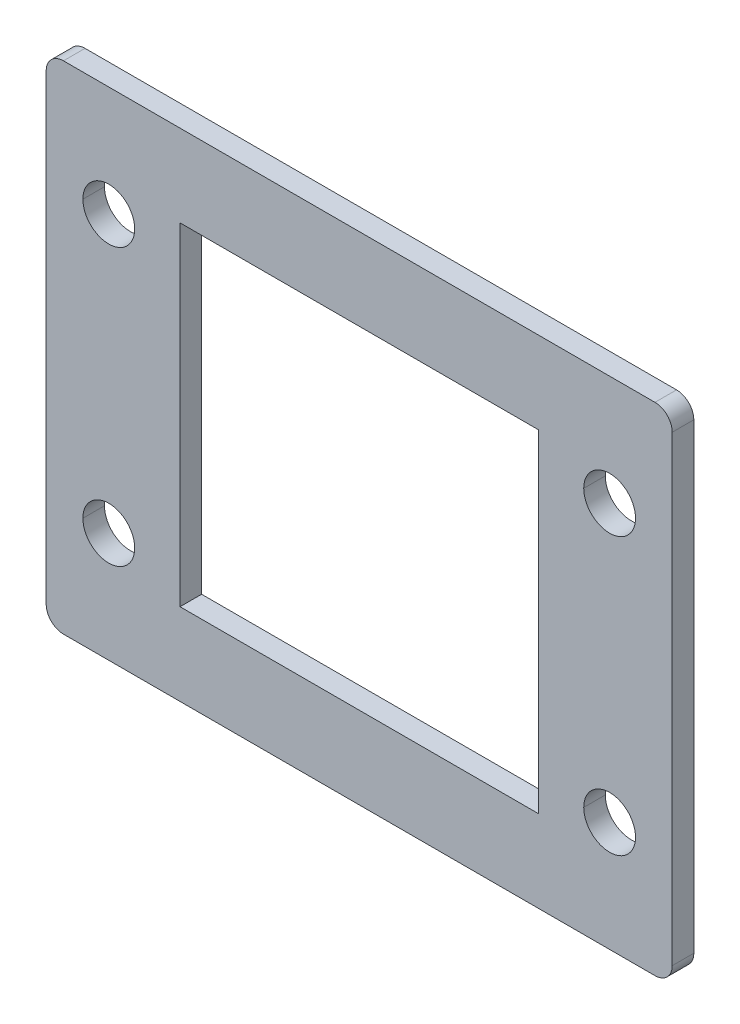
ISO-10303-21;
HEADER;
FILE_DESCRIPTION(('STEP AP214'),'2;1');
FILE_NAME('part.step','',(''),(''),'','','');
FILE_SCHEMA(('AUTOMOTIVE_DESIGN { 1 0 10303 214 1 1 1 1 }'));
ENDSEC;
DATA;
#1=APPLICATION_CONTEXT('core data for automotive mechanical design processes');
#2=APPLICATION_PROTOCOL_DEFINITION('international standard','automotive_design',2000,#1);
#3=PRODUCT_CONTEXT('',#1,'mechanical');
#4=PRODUCT('Part','Part','',(#3));
#5=PRODUCT_RELATED_PRODUCT_CATEGORY('part','',(#4));
#6=PRODUCT_DEFINITION_FORMATION('','',#4);
#7=PRODUCT_DEFINITION_CONTEXT('part definition',#1,'design');
#8=PRODUCT_DEFINITION('design','',#6,#7);
#9=PRODUCT_DEFINITION_SHAPE('','',#8);
#10=(LENGTH_UNIT() NAMED_UNIT(*) SI_UNIT(.MILLI.,.METRE.));
#11=(NAMED_UNIT(*) PLANE_ANGLE_UNIT() SI_UNIT($,.RADIAN.));
#12=(NAMED_UNIT(*) SI_UNIT($,.STERADIAN.) SOLID_ANGLE_UNIT());
#13=UNCERTAINTY_MEASURE_WITH_UNIT(LENGTH_MEASURE(1.E-05),#10,'distance_accuracy_value','');
#14=(GEOMETRIC_REPRESENTATION_CONTEXT(3) GLOBAL_UNCERTAINTY_ASSIGNED_CONTEXT((#13)) GLOBAL_UNIT_ASSIGNED_CONTEXT((#10,
#11,#12)) REPRESENTATION_CONTEXT('',''));
#15=CARTESIAN_POINT('',(0.,0.,0.));
#16=DIRECTION('',(0.,0.,1.));
#17=DIRECTION('',(1.,0.,0.));
#18=AXIS2_PLACEMENT_3D('',#15,#16,#17);
#19=CARTESIAN_POINT('',(3.82808590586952,41.3391777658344,23.4913418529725));
#20=DIRECTION('',(0.,0.,-1.));
#21=DIRECTION('',(-1.,0.,0.));
#22=AXIS2_PLACEMENT_3D('',#19,#20,#21);
#23=CYLINDRICAL_SURFACE('',#22,3.);
#24=DIRECTION('',(0.,0.,-1.));
#25=VECTOR('',#24,1.);
#26=CARTESIAN_POINT('',(6.82808590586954,41.3391777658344,23.4913418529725));
#27=LINE('',#26,#25);
#28=CARTESIAN_POINT('',(6.82808590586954,41.3391777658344,15.0060604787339));
#29=VERTEX_POINT('',#28);
#30=CARTESIAN_POINT('',(6.82808590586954,41.3391777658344,12.5060604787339));
#31=VERTEX_POINT('',#30);
#32=EDGE_CURVE('E210',#29,#31,#27,.T.);
#33=ORIENTED_EDGE('',*,*,#32,.F.);
#34=CARTESIAN_POINT('',(3.82808590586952,41.3391777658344,15.0060604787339));
#35=DIRECTION('',(0.,0.,-1.));
#36=DIRECTION('',(-1.,0.,0.));
#37=AXIS2_PLACEMENT_3D('',#34,#35,#36);
#38=CIRCLE('',#37,3.);
#39=CARTESIAN_POINT('',(0.828085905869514,41.3391777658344,15.0060604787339));
#40=VERTEX_POINT('',#39);
#41=EDGE_CURVE('E196',#40,#29,#38,.T.);
#42=ORIENTED_EDGE('',*,*,#41,.F.);
#43=DIRECTION('',(0.,0.,-1.));
#44=VECTOR('',#43,1.);
#45=CARTESIAN_POINT('',(0.828085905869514,41.3391777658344,23.4913418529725));
#46=LINE('',#45,#44);
#47=CARTESIAN_POINT('',(0.828085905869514,41.3391777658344,12.5060604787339));
#48=VERTEX_POINT('',#47);
#49=EDGE_CURVE('E219',#40,#48,#46,.T.);
#50=ORIENTED_EDGE('',*,*,#49,.T.);
#51=CARTESIAN_POINT('',(3.82808590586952,41.3391777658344,12.5060604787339));
#52=DIRECTION('',(0.,0.,1.));
#53=DIRECTION('',(1.,0.,0.));
#54=AXIS2_PLACEMENT_3D('',#51,#52,#53);
#55=CIRCLE('',#54,3.);
#56=EDGE_CURVE('E211',#31,#48,#55,.T.);
#57=ORIENTED_EDGE('',*,*,#56,.F.);
#58=EDGE_LOOP('',(#33,#42,#50,#57));
#59=FACE_BOUND('',#58,.T.);
#60=ADVANCED_FACE('F15',(#59),#23,.F.);
#61=CARTESIAN_POINT('',(-54.1719140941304,41.3391777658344,23.4913418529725));
#62=DIRECTION('',(0.,0.,-1.));
#63=DIRECTION('',(-1.,0.,0.));
#64=AXIS2_PLACEMENT_3D('',#61,#62,#63);
#65=CYLINDRICAL_SURFACE('',#64,3.);
#66=DIRECTION('',(0.,0.,-1.));
#67=VECTOR('',#66,1.);
#68=CARTESIAN_POINT('',(-51.1719140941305,41.3391777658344,23.4913418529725));
#69=LINE('',#68,#67);
#70=CARTESIAN_POINT('',(-51.1719140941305,41.3391777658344,15.0060604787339));
#71=VERTEX_POINT('',#70);
#72=CARTESIAN_POINT('',(-51.1719140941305,41.3391777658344,12.5060604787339));
#73=VERTEX_POINT('',#72);
#74=EDGE_CURVE('E242',#71,#73,#69,.T.);
#75=ORIENTED_EDGE('',*,*,#74,.F.);
#76=CARTESIAN_POINT('',(-54.1719140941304,41.3391777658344,15.0060604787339));
#77=DIRECTION('',(0.,0.,-1.));
#78=DIRECTION('',(-1.,0.,0.));
#79=AXIS2_PLACEMENT_3D('',#76,#77,#78);
#80=CIRCLE('',#79,3.);
#81=CARTESIAN_POINT('',(-57.1719140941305,41.3391777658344,15.0060604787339));
#82=VERTEX_POINT('',#81);
#83=EDGE_CURVE('E207',#82,#71,#80,.T.);
#84=ORIENTED_EDGE('',*,*,#83,.F.);
#85=DIRECTION('',(0.,0.,-1.));
#86=VECTOR('',#85,1.);
#87=CARTESIAN_POINT('',(-57.1719140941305,41.3391777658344,23.4913418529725));
#88=LINE('',#87,#86);
#89=CARTESIAN_POINT('',(-57.1719140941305,41.3391777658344,12.5060604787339));
#90=VERTEX_POINT('',#89);
#91=EDGE_CURVE('E261',#82,#90,#88,.T.);
#92=ORIENTED_EDGE('',*,*,#91,.T.);
#93=CARTESIAN_POINT('',(-54.1719140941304,41.3391777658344,12.5060604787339));
#94=DIRECTION('',(0.,0.,1.));
#95=DIRECTION('',(1.,0.,0.));
#96=AXIS2_PLACEMENT_3D('',#93,#94,#95);
#97=CIRCLE('',#96,3.);
#98=EDGE_CURVE('E379',#73,#90,#97,.T.);
#99=ORIENTED_EDGE('',*,*,#98,.F.);
#100=EDGE_LOOP('',(#75,#84,#92,#99));
#101=FACE_BOUND('',#100,.T.);
#102=ADVANCED_FACE('F446',(#101),#65,.F.);
#103=CARTESIAN_POINT('',(9.07808590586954,52.0891777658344,15.0060604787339));
#104=DIRECTION('',(0.,0.,-1.));
#105=DIRECTION('',(-1.,0.,0.));
#106=AXIS2_PLACEMENT_3D('',#103,#104,#105);
#107=CYLINDRICAL_SURFACE('',#106,2.);
#108=CARTESIAN_POINT('',(9.07808590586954,52.0891777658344,15.0060604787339));
#109=DIRECTION('',(0.,0.,1.));
#110=DIRECTION('',(-1.,0.,0.));
#111=AXIS2_PLACEMENT_3D('',#108,#109,#110);
#112=CIRCLE('',#111,2.);
#113=CARTESIAN_POINT('',(11.0780859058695,52.0891777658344,15.0060604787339));
#114=VERTEX_POINT('',#113);
#115=CARTESIAN_POINT('',(9.07808590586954,54.0891777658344,15.0060604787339));
#116=VERTEX_POINT('',#115);
#117=EDGE_CURVE('E321',#114,#116,#112,.T.);
#118=ORIENTED_EDGE('',*,*,#117,.F.);
#119=DIRECTION('',(0.,0.,1.));
#120=VECTOR('',#119,1.);
#121=CARTESIAN_POINT('',(11.0780859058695,52.0891777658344,15.0060604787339));
#122=LINE('',#121,#120);
#123=CARTESIAN_POINT('',(11.0780859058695,52.0891777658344,12.5060604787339));
#124=VERTEX_POINT('',#123);
#125=EDGE_CURVE('E246',#124,#114,#122,.T.);
#126=ORIENTED_EDGE('',*,*,#125,.F.);
#127=CARTESIAN_POINT('',(9.07808590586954,52.0891777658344,12.5060604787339));
#128=DIRECTION('',(0.,0.,-1.));
#129=DIRECTION('',(-1.,0.,0.));
#130=AXIS2_PLACEMENT_3D('',#127,#128,#129);
#131=CIRCLE('',#130,2.);
#132=CARTESIAN_POINT('',(9.07808590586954,54.0891777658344,12.5060604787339));
#133=VERTEX_POINT('',#132);
#134=EDGE_CURVE('E360',#133,#124,#131,.T.);
#135=ORIENTED_EDGE('',*,*,#134,.F.);
#136=DIRECTION('',(0.,0.,-1.));
#137=VECTOR('',#136,1.);
#138=CARTESIAN_POINT('',(9.07808590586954,54.0891777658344,15.0060604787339));
#139=LINE('',#138,#137);
#140=EDGE_CURVE('E411',#116,#133,#139,.T.);
#141=ORIENTED_EDGE('',*,*,#140,.F.);
#142=EDGE_LOOP('',(#118,#126,#135,#141));
#143=FACE_BOUND('',#142,.T.);
#144=ADVANCED_FACE('F450',(#143),#107,.T.);
#145=CARTESIAN_POINT('',(9.07808590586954,-1.41082223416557,15.0060604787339));
#146=DIRECTION('',(0.,0.,-1.));
#147=DIRECTION('',(-1.,0.,0.));
#148=AXIS2_PLACEMENT_3D('',#145,#146,#147);
#149=CYLINDRICAL_SURFACE('',#148,2.);
#150=CARTESIAN_POINT('',(9.07808590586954,-1.41082223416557,15.0060604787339));
#151=DIRECTION('',(0.,0.,1.));
#152=DIRECTION('',(-1.,0.,0.));
#153=AXIS2_PLACEMENT_3D('',#150,#151,#152);
#154=CIRCLE('',#153,2.);
#155=CARTESIAN_POINT('',(9.07808590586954,-3.41082223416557,15.0060604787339));
#156=VERTEX_POINT('',#155);
#157=CARTESIAN_POINT('',(11.0780859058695,-1.41082223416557,15.0060604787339));
#158=VERTEX_POINT('',#157);
#159=EDGE_CURVE('E313',#156,#158,#154,.T.);
#160=ORIENTED_EDGE('',*,*,#159,.F.);
#161=DIRECTION('',(0.,0.,1.));
#162=VECTOR('',#161,1.);
#163=CARTESIAN_POINT('',(9.07808590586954,-3.41082223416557,15.0060604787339));
#164=LINE('',#163,#162);
#165=CARTESIAN_POINT('',(9.07808590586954,-3.41082223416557,12.5060604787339));
#166=VERTEX_POINT('',#165);
#167=EDGE_CURVE('E247',#166,#156,#164,.T.);
#168=ORIENTED_EDGE('',*,*,#167,.F.);
#169=CARTESIAN_POINT('',(9.07808590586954,-1.41082223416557,12.5060604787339));
#170=DIRECTION('',(0.,0.,-1.));
#171=DIRECTION('',(-1.,0.,0.));
#172=AXIS2_PLACEMENT_3D('',#169,#170,#171);
#173=CIRCLE('',#172,2.);
#174=CARTESIAN_POINT('',(11.0780859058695,-1.41082223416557,12.5060604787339));
#175=VERTEX_POINT('',#174);
#176=EDGE_CURVE('E274',#175,#166,#173,.T.);
#177=ORIENTED_EDGE('',*,*,#176,.F.);
#178=DIRECTION('',(0.,0.,-1.));
#179=VECTOR('',#178,1.);
#180=CARTESIAN_POINT('',(11.0780859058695,-1.41082223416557,15.0060604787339));
#181=LINE('',#180,#179);
#182=EDGE_CURVE('E243',#158,#175,#181,.T.);
#183=ORIENTED_EDGE('',*,*,#182,.F.);
#184=EDGE_LOOP('',(#160,#168,#177,#183));
#185=FACE_BOUND('',#184,.T.);
#186=ADVANCED_FACE('F455',(#185),#149,.T.);
#187=CARTESIAN_POINT('',(-59.4219140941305,-1.41082223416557,15.0060604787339));
#188=DIRECTION('',(0.,0.,-1.));
#189=DIRECTION('',(-1.,0.,0.));
#190=AXIS2_PLACEMENT_3D('',#187,#188,#189);
#191=CYLINDRICAL_SURFACE('',#190,2.);
#192=CARTESIAN_POINT('',(-59.4219140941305,-1.41082223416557,15.0060604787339));
#193=DIRECTION('',(0.,0.,1.));
#194=DIRECTION('',(-1.,0.,0.));
#195=AXIS2_PLACEMENT_3D('',#192,#193,#194);
#196=CIRCLE('',#195,2.);
#197=CARTESIAN_POINT('',(-61.4219140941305,-1.41082223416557,15.0060604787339));
#198=VERTEX_POINT('',#197);
#199=CARTESIAN_POINT('',(-59.4219140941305,-3.41082223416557,15.0060604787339));
#200=VERTEX_POINT('',#199);
#201=EDGE_CURVE('E305',#198,#200,#196,.T.);
#202=ORIENTED_EDGE('',*,*,#201,.F.);
#203=DIRECTION('',(0.,0.,1.));
#204=VECTOR('',#203,1.);
#205=CARTESIAN_POINT('',(-61.4219140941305,-1.41082223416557,15.0060604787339));
#206=LINE('',#205,#204);
#207=CARTESIAN_POINT('',(-61.4219140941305,-1.41082223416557,12.5060604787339));
#208=VERTEX_POINT('',#207);
#209=EDGE_CURVE('E368',#208,#198,#206,.T.);
#210=ORIENTED_EDGE('',*,*,#209,.F.);
#211=CARTESIAN_POINT('',(-59.4219140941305,-1.41082223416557,12.5060604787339));
#212=DIRECTION('',(0.,0.,-1.));
#213=DIRECTION('',(-1.,0.,0.));
#214=AXIS2_PLACEMENT_3D('',#211,#212,#213);
#215=CIRCLE('',#214,2.);
#216=CARTESIAN_POINT('',(-59.4219140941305,-3.41082223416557,12.5060604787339));
#217=VERTEX_POINT('',#216);
#218=EDGE_CURVE('E273',#217,#208,#215,.T.);
#219=ORIENTED_EDGE('',*,*,#218,.F.);
#220=DIRECTION('',(0.,0.,-1.));
#221=VECTOR('',#220,1.);
#222=CARTESIAN_POINT('',(-59.4219140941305,-3.41082223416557,15.0060604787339));
#223=LINE('',#222,#221);
#224=EDGE_CURVE('E371',#200,#217,#223,.T.);
#225=ORIENTED_EDGE('',*,*,#224,.F.);
#226=EDGE_LOOP('',(#202,#210,#219,#225));
#227=FACE_BOUND('',#226,.T.);
#228=ADVANCED_FACE('F462',(#227),#191,.T.);
#229=CARTESIAN_POINT('',(-59.4219140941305,52.0891777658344,15.0060604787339));
#230=DIRECTION('',(0.,0.,-1.));
#231=DIRECTION('',(-1.,0.,0.));
#232=AXIS2_PLACEMENT_3D('',#229,#230,#231);
#233=CYLINDRICAL_SURFACE('',#232,2.);
#234=CARTESIAN_POINT('',(-59.4219140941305,52.0891777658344,15.0060604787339));
#235=DIRECTION('',(0.,0.,1.));
#236=DIRECTION('',(-1.,0.,0.));
#237=AXIS2_PLACEMENT_3D('',#234,#235,#236);
#238=CIRCLE('',#237,2.);
#239=CARTESIAN_POINT('',(-59.4219140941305,54.0891777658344,15.0060604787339));
#240=VERTEX_POINT('',#239);
#241=CARTESIAN_POINT('',(-61.4219140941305,52.0891777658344,15.0060604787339));
#242=VERTEX_POINT('',#241);
#243=EDGE_CURVE('E297',#240,#242,#238,.T.);
#244=ORIENTED_EDGE('',*,*,#243,.F.);
#245=DIRECTION('',(0.,0.,1.));
#246=VECTOR('',#245,1.);
#247=CARTESIAN_POINT('',(-59.4219140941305,54.0891777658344,15.0060604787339));
#248=LINE('',#247,#246);
#249=CARTESIAN_POINT('',(-59.4219140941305,54.0891777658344,12.5060604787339));
#250=VERTEX_POINT('',#249);
#251=EDGE_CURVE('E408',#250,#240,#248,.T.);
#252=ORIENTED_EDGE('',*,*,#251,.F.);
#253=CARTESIAN_POINT('',(-59.4219140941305,52.0891777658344,12.5060604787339));
#254=DIRECTION('',(0.,0.,-1.));
#255=DIRECTION('',(-1.,0.,0.));
#256=AXIS2_PLACEMENT_3D('',#253,#254,#255);
#257=CIRCLE('',#256,2.);
#258=CARTESIAN_POINT('',(-61.4219140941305,52.0891777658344,12.5060604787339));
#259=VERTEX_POINT('',#258);
#260=EDGE_CURVE('E352',#259,#250,#257,.T.);
#261=ORIENTED_EDGE('',*,*,#260,.F.);
#262=DIRECTION('',(0.,0.,-1.));
#263=VECTOR('',#262,1.);
#264=CARTESIAN_POINT('',(-61.4219140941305,52.0891777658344,15.0060604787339));
#265=LINE('',#264,#263);
#266=EDGE_CURVE('E372',#242,#259,#265,.T.);
#267=ORIENTED_EDGE('',*,*,#266,.F.);
#268=EDGE_LOOP('',(#244,#252,#261,#267));
#269=FACE_BOUND('',#268,.T.);
#270=ADVANCED_FACE('F466',(#269),#233,.T.);
#271=CARTESIAN_POINT('',(3.82808590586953,9.33917776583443,71.6143637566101));
#272=DIRECTION('',(0.,0.,-1.));
#273=DIRECTION('',(-1.,0.,0.));
#274=AXIS2_PLACEMENT_3D('',#271,#272,#273);
#275=CYLINDRICAL_SURFACE('',#274,3.);
#276=DIRECTION('',(0.,0.,-1.));
#277=VECTOR('',#276,1.);
#278=CARTESIAN_POINT('',(6.82808590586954,9.33917776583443,71.6143637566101));
#279=LINE('',#278,#277);
#280=CARTESIAN_POINT('',(6.82808590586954,9.33917776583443,15.0060604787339));
#281=VERTEX_POINT('',#280);
#282=CARTESIAN_POINT('',(6.82808590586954,9.33917776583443,12.5060604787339));
#283=VERTEX_POINT('',#282);
#284=EDGE_CURVE('E224',#281,#283,#279,.T.);
#285=ORIENTED_EDGE('',*,*,#284,.F.);
#286=CARTESIAN_POINT('',(3.82808590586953,9.33917776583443,15.0060604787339));
#287=DIRECTION('',(0.,0.,-1.));
#288=DIRECTION('',(-1.,0.,0.));
#289=AXIS2_PLACEMENT_3D('',#286,#287,#288);
#290=CIRCLE('',#289,3.);
#291=CARTESIAN_POINT('',(0.828085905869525,9.33917776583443,15.0060604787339));
#292=VERTEX_POINT('',#291);
#293=EDGE_CURVE('E344',#292,#281,#290,.T.);
#294=ORIENTED_EDGE('',*,*,#293,.F.);
#295=DIRECTION('',(0.,0.,-1.));
#296=VECTOR('',#295,1.);
#297=CARTESIAN_POINT('',(0.828085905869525,9.33917776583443,71.6143637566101));
#298=LINE('',#297,#296);
#299=CARTESIAN_POINT('',(0.828085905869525,9.33917776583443,12.5060604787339));
#300=VERTEX_POINT('',#299);
#301=EDGE_CURVE('E235',#292,#300,#298,.T.);
#302=ORIENTED_EDGE('',*,*,#301,.T.);
#303=CARTESIAN_POINT('',(3.82808590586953,9.33917776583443,12.5060604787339));
#304=DIRECTION('',(0.,0.,1.));
#305=DIRECTION('',(-1.,0.,0.));
#306=AXIS2_PLACEMENT_3D('',#303,#304,#305);
#307=CIRCLE('',#306,3.);
#308=EDGE_CURVE('E395',#283,#300,#307,.T.);
#309=ORIENTED_EDGE('',*,*,#308,.F.);
#310=EDGE_LOOP('',(#285,#294,#302,#309));
#311=FACE_BOUND('',#310,.T.);
#312=ADVANCED_FACE('F470',(#311),#275,.F.);
#313=CARTESIAN_POINT('',(-54.1719140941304,9.33917776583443,71.6143637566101));
#314=DIRECTION('',(0.,0.,-1.));
#315=DIRECTION('',(-1.,0.,0.));
#316=AXIS2_PLACEMENT_3D('',#313,#314,#315);
#317=CYLINDRICAL_SURFACE('',#316,3.);
#318=DIRECTION('',(0.,0.,-1.));
#319=VECTOR('',#318,1.);
#320=CARTESIAN_POINT('',(-51.1719140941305,9.33917776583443,71.6143637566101));
#321=LINE('',#320,#319);
#322=CARTESIAN_POINT('',(-51.1719140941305,9.33917776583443,15.0060604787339));
#323=VERTEX_POINT('',#322);
#324=CARTESIAN_POINT('',(-51.1719140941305,9.33917776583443,12.5060604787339));
#325=VERTEX_POINT('',#324);
#326=EDGE_CURVE('E252',#323,#325,#321,.T.);
#327=ORIENTED_EDGE('',*,*,#326,.F.);
#328=CARTESIAN_POINT('',(-54.1719140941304,9.33917776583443,15.0060604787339));
#329=DIRECTION('',(0.,0.,-1.));
#330=DIRECTION('',(-1.,0.,0.));
#331=AXIS2_PLACEMENT_3D('',#328,#329,#330);
#332=CIRCLE('',#331,3.);
#333=CARTESIAN_POINT('',(-57.1719140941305,9.33917776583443,15.0060604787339));
#334=VERTEX_POINT('',#333);
#335=EDGE_CURVE('E341',#334,#323,#332,.T.);
#336=ORIENTED_EDGE('',*,*,#335,.F.);
#337=DIRECTION('',(0.,0.,-1.));
#338=VECTOR('',#337,1.);
#339=CARTESIAN_POINT('',(-57.1719140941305,9.33917776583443,71.6143637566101));
#340=LINE('',#339,#338);
#341=CARTESIAN_POINT('',(-57.1719140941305,9.33917776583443,12.5060604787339));
#342=VERTEX_POINT('',#341);
#343=EDGE_CURVE('E265',#334,#342,#340,.T.);
#344=ORIENTED_EDGE('',*,*,#343,.T.);
#345=CARTESIAN_POINT('',(-54.1719140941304,9.33917776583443,12.5060604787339));
#346=DIRECTION('',(0.,0.,1.));
#347=DIRECTION('',(1.,0.,0.));
#348=AXIS2_PLACEMENT_3D('',#345,#346,#347);
#349=CIRCLE('',#348,3.);
#350=EDGE_CURVE('E382',#325,#342,#349,.T.);
#351=ORIENTED_EDGE('',*,*,#350,.F.);
#352=EDGE_LOOP('',(#327,#336,#344,#351));
#353=FACE_BOUND('',#352,.T.);
#354=ADVANCED_FACE('F474',(#353),#317,.F.);
#355=CARTESIAN_POINT('',(-45.9219140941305,6.08917776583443,71.6143637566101));
#356=DIRECTION('',(1.,0.,0.));
#357=DIRECTION('',(0.,1.,0.));
#358=AXIS2_PLACEMENT_3D('',#355,#356,#357);
#359=PLANE('',#358);
#360=DIRECTION('',(0.,0.,-1.));
#361=VECTOR('',#360,1.);
#362=CARTESIAN_POINT('',(-45.9219140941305,6.08917776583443,71.6143637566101));
#363=LINE('',#362,#361);
#364=CARTESIAN_POINT('',(-45.9219140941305,6.08917776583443,15.0060604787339));
#365=VERTEX_POINT('',#364);
#366=CARTESIAN_POINT('',(-45.9219140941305,6.08917776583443,12.5060604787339));
#367=VERTEX_POINT('',#366);
#368=EDGE_CURVE('E10',#365,#367,#363,.T.);
#369=ORIENTED_EDGE('',*,*,#368,.T.);
#370=DIRECTION('',(0.,-1.,0.));
#371=VECTOR('',#370,1.);
#372=CARTESIAN_POINT('',(-45.9219140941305,6.08917776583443,12.5060604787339));
#373=LINE('',#372,#371);
#374=CARTESIAN_POINT('',(-45.9219140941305,44.5891777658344,12.5060604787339));
#375=VERTEX_POINT('',#374);
#376=EDGE_CURVE('E292',#375,#367,#373,.T.);
#377=ORIENTED_EDGE('',*,*,#376,.F.);
#378=DIRECTION('',(0.,0.,-1.));
#379=VECTOR('',#378,1.);
#380=CARTESIAN_POINT('',(-45.9219140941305,44.5891777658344,71.6143637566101));
#381=LINE('',#380,#379);
#382=CARTESIAN_POINT('',(-45.9219140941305,44.5891777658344,15.0060604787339));
#383=VERTEX_POINT('',#382);
#384=EDGE_CURVE('E43',#383,#375,#381,.T.);
#385=ORIENTED_EDGE('',*,*,#384,.F.);
#386=DIRECTION('',(0.,1.,0.));
#387=VECTOR('',#386,1.);
#388=CARTESIAN_POINT('',(-45.9219140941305,6.08917776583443,15.0060604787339));
#389=LINE('',#388,#387);
#390=EDGE_CURVE('E337',#365,#383,#389,.T.);
#391=ORIENTED_EDGE('',*,*,#390,.F.);
#392=EDGE_LOOP('',(#369,#377,#385,#391));
#393=FACE_BOUND('',#392,.T.);
#394=ADVANCED_FACE('F441',(#393),#359,.T.);
#395=CARTESIAN_POINT('',(-45.9219140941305,6.08917776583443,71.6143637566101));
#396=DIRECTION('',(0.,1.,0.));
#397=DIRECTION('',(1.,0.,0.));
#398=AXIS2_PLACEMENT_3D('',#395,#396,#397);
#399=PLANE('',#398);
#400=DIRECTION('',(0.,0.,-1.));
#401=VECTOR('',#400,1.);
#402=CARTESIAN_POINT('',(-4.42191409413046,6.08917776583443,71.6143637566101));
#403=LINE('',#402,#401);
#404=CARTESIAN_POINT('',(-4.42191409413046,6.08917776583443,15.0060604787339));
#405=VERTEX_POINT('',#404);
#406=CARTESIAN_POINT('',(-4.42191409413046,6.08917776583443,12.5060604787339));
#407=VERTEX_POINT('',#406);
#408=EDGE_CURVE('E18',#405,#407,#403,.T.);
#409=ORIENTED_EDGE('',*,*,#408,.T.);
#410=DIRECTION('',(1.,0.,0.));
#411=VECTOR('',#410,1.);
#412=CARTESIAN_POINT('',(-45.9219140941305,6.08917776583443,12.5060604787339));
#413=LINE('',#412,#411);
#414=EDGE_CURVE('E391',#367,#407,#413,.T.);
#415=ORIENTED_EDGE('',*,*,#414,.F.);
#416=ORIENTED_EDGE('',*,*,#368,.F.);
#417=DIRECTION('',(-1.,0.,0.));
#418=VECTOR('',#417,1.);
#419=CARTESIAN_POINT('',(-45.9219140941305,6.08917776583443,15.0060604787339));
#420=LINE('',#419,#418);
#421=EDGE_CURVE('E333',#405,#365,#420,.T.);
#422=ORIENTED_EDGE('',*,*,#421,.F.);
#423=EDGE_LOOP('',(#409,#415,#416,#422));
#424=FACE_BOUND('',#423,.T.);
#425=ADVANCED_FACE('F426',(#424),#399,.T.);
#426=CARTESIAN_POINT('',(-4.42191409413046,6.08917776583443,71.6143637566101));
#427=DIRECTION('',(-1.,0.,0.));
#428=DIRECTION('',(0.,0.,1.));
#429=AXIS2_PLACEMENT_3D('',#426,#427,#428);
#430=PLANE('',#429);
#431=DIRECTION('',(0.,0.,-1.));
#432=VECTOR('',#431,1.);
#433=CARTESIAN_POINT('',(-4.42191409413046,44.5891777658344,71.6143637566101));
#434=LINE('',#433,#432);
#435=CARTESIAN_POINT('',(-4.42191409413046,44.5891777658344,15.0060604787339));
#436=VERTEX_POINT('',#435);
#437=CARTESIAN_POINT('',(-4.42191409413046,44.5891777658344,12.5060604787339));
#438=VERTEX_POINT('',#437);
#439=EDGE_CURVE('E415',#436,#438,#434,.T.);
#440=ORIENTED_EDGE('',*,*,#439,.T.);
#441=DIRECTION('',(0.,1.,0.));
#442=VECTOR('',#441,1.);
#443=CARTESIAN_POINT('',(-4.42191409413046,6.08917776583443,12.5060604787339));
#444=LINE('',#443,#442);
#445=EDGE_CURVE('E293',#407,#438,#444,.T.);
#446=ORIENTED_EDGE('',*,*,#445,.F.);
#447=ORIENTED_EDGE('',*,*,#408,.F.);
#448=DIRECTION('',(0.,-1.,0.));
#449=VECTOR('',#448,1.);
#450=CARTESIAN_POINT('',(-4.42191409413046,6.08917776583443,15.0060604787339));
#451=LINE('',#450,#449);
#452=EDGE_CURVE('E329',#436,#405,#451,.T.);
#453=ORIENTED_EDGE('',*,*,#452,.F.);
#454=EDGE_LOOP('',(#440,#446,#447,#453));
#455=FACE_BOUND('',#454,.T.);
#456=ADVANCED_FACE('F430',(#455),#430,.T.);
#457=CARTESIAN_POINT('',(-45.9219140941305,44.5891777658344,71.6143637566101));
#458=DIRECTION('',(0.,-1.,0.));
#459=DIRECTION('',(0.,0.,-1.));
#460=AXIS2_PLACEMENT_3D('',#457,#458,#459);
#461=PLANE('',#460);
#462=ORIENTED_EDGE('',*,*,#384,.T.);
#463=DIRECTION('',(-1.,0.,0.));
#464=VECTOR('',#463,1.);
#465=CARTESIAN_POINT('',(-45.9219140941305,44.5891777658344,12.5060604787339));
#466=LINE('',#465,#464);
#467=EDGE_CURVE('E288',#438,#375,#466,.T.);
#468=ORIENTED_EDGE('',*,*,#467,.F.);
#469=ORIENTED_EDGE('',*,*,#439,.F.);
#470=DIRECTION('',(1.,0.,0.));
#471=VECTOR('',#470,1.);
#472=CARTESIAN_POINT('',(-45.9219140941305,44.5891777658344,15.0060604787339));
#473=LINE('',#472,#471);
#474=EDGE_CURVE('E325',#383,#436,#473,.T.);
#475=ORIENTED_EDGE('',*,*,#474,.F.);
#476=EDGE_LOOP('',(#462,#468,#469,#475));
#477=FACE_BOUND('',#476,.T.);
#478=ADVANCED_FACE('F432',(#477),#461,.T.);
#479=CARTESIAN_POINT('',(-61.4219140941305,54.0891777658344,15.0060604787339));
#480=DIRECTION('',(0.,-1.,0.));
#481=DIRECTION('',(0.,0.,-1.));
#482=AXIS2_PLACEMENT_3D('',#479,#480,#481);
#483=PLANE('',#482);
#484=DIRECTION('',(-1.,0.,0.));
#485=VECTOR('',#484,1.);
#486=CARTESIAN_POINT('',(-61.4219140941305,54.0891777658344,12.5060604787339));
#487=LINE('',#486,#485);
#488=EDGE_CURVE('E356',#133,#250,#487,.T.);
#489=ORIENTED_EDGE('',*,*,#488,.T.);
#490=ORIENTED_EDGE('',*,*,#251,.T.);
#491=DIRECTION('',(-1.,0.,0.));
#492=VECTOR('',#491,1.);
#493=CARTESIAN_POINT('',(-61.4219140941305,54.0891777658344,15.0060604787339));
#494=LINE('',#493,#492);
#495=EDGE_CURVE('E287',#116,#240,#494,.T.);
#496=ORIENTED_EDGE('',*,*,#495,.F.);
#497=ORIENTED_EDGE('',*,*,#140,.T.);
#498=EDGE_LOOP('',(#489,#490,#496,#497));
#499=FACE_BOUND('',#498,.T.);
#500=ADVANCED_FACE('F439',(#499),#483,.F.);
#501=CARTESIAN_POINT('',(11.0780859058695,-3.41082223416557,15.0060604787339));
#502=DIRECTION('',(-1.,0.,0.));
#503=DIRECTION('',(0.,0.,1.));
#504=AXIS2_PLACEMENT_3D('',#501,#502,#503);
#505=PLANE('',#504);
#506=DIRECTION('',(0.,1.,0.));
#507=VECTOR('',#506,1.);
#508=CARTESIAN_POINT('',(11.0780859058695,-3.41082223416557,15.0060604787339));
#509=LINE('',#508,#507);
#510=EDGE_CURVE('E317',#158,#114,#509,.T.);
#511=ORIENTED_EDGE('',*,*,#510,.F.);
#512=ORIENTED_EDGE('',*,*,#182,.T.);
#513=DIRECTION('',(0.,1.,0.));
#514=VECTOR('',#513,1.);
#515=CARTESIAN_POINT('',(11.0780859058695,-3.41082223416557,12.5060604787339));
#516=LINE('',#515,#514);
#517=EDGE_CURVE('E364',#175,#124,#516,.T.);
#518=ORIENTED_EDGE('',*,*,#517,.T.);
#519=ORIENTED_EDGE('',*,*,#125,.T.);
#520=EDGE_LOOP('',(#511,#512,#518,#519));
#521=FACE_BOUND('',#520,.T.);
#522=ADVANCED_FACE('F484',(#521),#505,.F.);
#523=CARTESIAN_POINT('',(-61.4219140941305,-3.41082223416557,15.0060604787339));
#524=DIRECTION('',(0.,1.,0.));
#525=DIRECTION('',(1.,0.,0.));
#526=AXIS2_PLACEMENT_3D('',#523,#524,#525);
#527=PLANE('',#526);
#528=DIRECTION('',(1.,0.,0.));
#529=VECTOR('',#528,1.);
#530=CARTESIAN_POINT('',(-61.4219140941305,-3.41082223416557,15.0060604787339));
#531=LINE('',#530,#529);
#532=EDGE_CURVE('E309',#200,#156,#531,.T.);
#533=ORIENTED_EDGE('',*,*,#532,.F.);
#534=ORIENTED_EDGE('',*,*,#224,.T.);
#535=DIRECTION('',(1.,0.,0.));
#536=VECTOR('',#535,1.);
#537=CARTESIAN_POINT('',(-61.4219140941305,-3.41082223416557,12.5060604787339));
#538=LINE('',#537,#536);
#539=EDGE_CURVE('E269',#217,#166,#538,.T.);
#540=ORIENTED_EDGE('',*,*,#539,.T.);
#541=ORIENTED_EDGE('',*,*,#167,.T.);
#542=EDGE_LOOP('',(#533,#534,#540,#541));
#543=FACE_BOUND('',#542,.T.);
#544=ADVANCED_FACE('F481',(#543),#527,.F.);
#545=CARTESIAN_POINT('',(-61.4219140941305,-3.41082223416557,15.0060604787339));
#546=DIRECTION('',(1.,0.,0.));
#547=DIRECTION('',(0.,1.,0.));
#548=AXIS2_PLACEMENT_3D('',#545,#546,#547);
#549=PLANE('',#548);
#550=DIRECTION('',(0.,-1.,0.));
#551=VECTOR('',#550,1.);
#552=CARTESIAN_POINT('',(-61.4219140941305,-3.41082223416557,15.0060604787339));
#553=LINE('',#552,#551);
#554=EDGE_CURVE('E301',#242,#198,#553,.T.);
#555=ORIENTED_EDGE('',*,*,#554,.F.);
#556=ORIENTED_EDGE('',*,*,#266,.T.);
#557=DIRECTION('',(0.,-1.,0.));
#558=VECTOR('',#557,1.);
#559=CARTESIAN_POINT('',(-61.4219140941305,-3.41082223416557,12.5060604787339));
#560=LINE('',#559,#558);
#561=EDGE_CURVE('E206',#259,#208,#560,.T.);
#562=ORIENTED_EDGE('',*,*,#561,.T.);
#563=ORIENTED_EDGE('',*,*,#209,.T.);
#564=EDGE_LOOP('',(#555,#556,#562,#563));
#565=FACE_BOUND('',#564,.T.);
#566=ADVANCED_FACE('F483',(#565),#549,.F.);
#567=CARTESIAN_POINT('',(-61.4219140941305,54.0891777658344,12.5060604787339));
#568=DIRECTION('',(0.,0.,-1.));
#569=DIRECTION('',(0.,-1.,0.));
#570=AXIS2_PLACEMENT_3D('',#567,#568,#569);
#571=PLANE('',#570);
#572=CARTESIAN_POINT('',(3.82808590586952,41.3391777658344,12.5060604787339));
#573=DIRECTION('',(0.,0.,1.));
#574=DIRECTION('',(1.,0.,0.));
#575=AXIS2_PLACEMENT_3D('',#572,#573,#574);
#576=CIRCLE('',#575,3.);
#577=EDGE_CURVE('E216',#48,#31,#576,.T.);
#578=ORIENTED_EDGE('',*,*,#577,.T.);
#579=ORIENTED_EDGE('',*,*,#56,.T.);
#580=EDGE_LOOP('',(#578,#579));
#581=FACE_BOUND('',#580,.T.);
#582=CARTESIAN_POINT('',(3.82808590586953,9.33917776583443,12.5060604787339));
#583=DIRECTION('',(0.,0.,1.));
#584=DIRECTION('',(-1.,0.,0.));
#585=AXIS2_PLACEMENT_3D('',#582,#583,#584);
#586=CIRCLE('',#585,3.);
#587=EDGE_CURVE('E228',#300,#283,#586,.T.);
#588=ORIENTED_EDGE('',*,*,#587,.T.);
#589=ORIENTED_EDGE('',*,*,#308,.T.);
#590=EDGE_LOOP('',(#588,#589));
#591=FACE_BOUND('',#590,.T.);
#592=ORIENTED_EDGE('',*,*,#445,.T.);
#593=ORIENTED_EDGE('',*,*,#467,.T.);
#594=ORIENTED_EDGE('',*,*,#376,.T.);
#595=ORIENTED_EDGE('',*,*,#414,.T.);
#596=EDGE_LOOP('',(#592,#593,#594,#595));
#597=FACE_BOUND('',#596,.T.);
#598=CARTESIAN_POINT('',(-54.1719140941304,9.33917776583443,12.5060604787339));
#599=DIRECTION('',(0.,0.,1.));
#600=DIRECTION('',(1.,0.,0.));
#601=AXIS2_PLACEMENT_3D('',#598,#599,#600);
#602=CIRCLE('',#601,3.);
#603=EDGE_CURVE('E256',#342,#325,#602,.T.);
#604=ORIENTED_EDGE('',*,*,#603,.T.);
#605=ORIENTED_EDGE('',*,*,#350,.T.);
#606=EDGE_LOOP('',(#604,#605));
#607=FACE_BOUND('',#606,.T.);
#608=CARTESIAN_POINT('',(-54.1719140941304,41.3391777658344,12.5060604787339));
#609=DIRECTION('',(0.,0.,1.));
#610=DIRECTION('',(1.,0.,0.));
#611=AXIS2_PLACEMENT_3D('',#608,#609,#610);
#612=CIRCLE('',#611,3.);
#613=EDGE_CURVE('E251',#90,#73,#612,.T.);
#614=ORIENTED_EDGE('',*,*,#613,.T.);
#615=ORIENTED_EDGE('',*,*,#98,.T.);
#616=EDGE_LOOP('',(#614,#615));
#617=FACE_BOUND('',#616,.T.);
#618=ORIENTED_EDGE('',*,*,#561,.F.);
#619=ORIENTED_EDGE('',*,*,#260,.T.);
#620=ORIENTED_EDGE('',*,*,#488,.F.);
#621=ORIENTED_EDGE('',*,*,#134,.T.);
#622=ORIENTED_EDGE('',*,*,#517,.F.);
#623=ORIENTED_EDGE('',*,*,#176,.T.);
#624=ORIENTED_EDGE('',*,*,#539,.F.);
#625=ORIENTED_EDGE('',*,*,#218,.T.);
#626=EDGE_LOOP('',(#618,#619,#620,#621,#622,#623,#624,#625));
#627=FACE_BOUND('',#626,.T.);
#628=ADVANCED_FACE('F428',(#581,#591,#597,#607,#617,#627),#571,.T.);
#629=CARTESIAN_POINT('',(-61.4219140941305,54.0891777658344,15.0060604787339));
#630=DIRECTION('',(0.,0.,-1.));
#631=DIRECTION('',(0.,-1.,0.));
#632=AXIS2_PLACEMENT_3D('',#629,#630,#631);
#633=PLANE('',#632);
#634=ORIENTED_EDGE('',*,*,#41,.T.);
#635=CARTESIAN_POINT('',(3.82808590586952,41.3391777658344,15.0060604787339));
#636=DIRECTION('',(0.,0.,-1.));
#637=DIRECTION('',(-1.,0.,0.));
#638=AXIS2_PLACEMENT_3D('',#635,#636,#637);
#639=CIRCLE('',#638,3.);
#640=EDGE_CURVE('E201',#29,#40,#639,.T.);
#641=ORIENTED_EDGE('',*,*,#640,.T.);
#642=EDGE_LOOP('',(#634,#641));
#643=FACE_BOUND('',#642,.T.);
#644=ORIENTED_EDGE('',*,*,#83,.T.);
#645=CARTESIAN_POINT('',(-54.1719140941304,41.3391777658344,15.0060604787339));
#646=DIRECTION('',(0.,0.,-1.));
#647=DIRECTION('',(-1.,0.,0.));
#648=AXIS2_PLACEMENT_3D('',#645,#646,#647);
#649=CIRCLE('',#648,3.);
#650=EDGE_CURVE('E238',#71,#82,#649,.T.);
#651=ORIENTED_EDGE('',*,*,#650,.T.);
#652=EDGE_LOOP('',(#644,#651));
#653=FACE_BOUND('',#652,.T.);
#654=ORIENTED_EDGE('',*,*,#293,.T.);
#655=CARTESIAN_POINT('',(3.82808590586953,9.33917776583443,15.0060604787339));
#656=DIRECTION('',(0.,0.,-1.));
#657=DIRECTION('',(-1.,0.,0.));
#658=AXIS2_PLACEMENT_3D('',#655,#656,#657);
#659=CIRCLE('',#658,3.);
#660=EDGE_CURVE('E229',#281,#292,#659,.T.);
#661=ORIENTED_EDGE('',*,*,#660,.T.);
#662=EDGE_LOOP('',(#654,#661));
#663=FACE_BOUND('',#662,.T.);
#664=ORIENTED_EDGE('',*,*,#335,.T.);
#665=CARTESIAN_POINT('',(-54.1719140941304,9.33917776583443,15.0060604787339));
#666=DIRECTION('',(0.,0.,-1.));
#667=DIRECTION('',(-1.,0.,0.));
#668=AXIS2_PLACEMENT_3D('',#665,#666,#667);
#669=CIRCLE('',#668,3.);
#670=EDGE_CURVE('E257',#323,#334,#669,.T.);
#671=ORIENTED_EDGE('',*,*,#670,.T.);
#672=EDGE_LOOP('',(#664,#671));
#673=FACE_BOUND('',#672,.T.);
#674=ORIENTED_EDGE('',*,*,#474,.T.);
#675=ORIENTED_EDGE('',*,*,#452,.T.);
#676=ORIENTED_EDGE('',*,*,#421,.T.);
#677=ORIENTED_EDGE('',*,*,#390,.T.);
#678=EDGE_LOOP('',(#674,#675,#676,#677));
#679=FACE_BOUND('',#678,.T.);
#680=ORIENTED_EDGE('',*,*,#495,.T.);
#681=ORIENTED_EDGE('',*,*,#243,.T.);
#682=ORIENTED_EDGE('',*,*,#554,.T.);
#683=ORIENTED_EDGE('',*,*,#201,.T.);
#684=ORIENTED_EDGE('',*,*,#532,.T.);
#685=ORIENTED_EDGE('',*,*,#159,.T.);
#686=ORIENTED_EDGE('',*,*,#510,.T.);
#687=ORIENTED_EDGE('',*,*,#117,.T.);
#688=EDGE_LOOP('',(#680,#681,#682,#683,#684,#685,#686,#687));
#689=FACE_BOUND('',#688,.T.);
#690=ADVANCED_FACE('F198',(#643,#653,#663,#673,#679,#689),#633,.F.);
#691=CARTESIAN_POINT('',(-54.1719140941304,9.33917776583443,71.6143637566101));
#692=DIRECTION('',(0.,0.,-1.));
#693=DIRECTION('',(-1.,0.,0.));
#694=AXIS2_PLACEMENT_3D('',#691,#692,#693);
#695=CYLINDRICAL_SURFACE('',#694,3.);
#696=ORIENTED_EDGE('',*,*,#670,.F.);
#697=ORIENTED_EDGE('',*,*,#326,.T.);
#698=ORIENTED_EDGE('',*,*,#603,.F.);
#699=ORIENTED_EDGE('',*,*,#343,.F.);
#700=EDGE_LOOP('',(#696,#697,#698,#699));
#701=FACE_BOUND('',#700,.T.);
#702=ADVANCED_FACE('F521',(#701),#695,.F.);
#703=CARTESIAN_POINT('',(3.82808590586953,9.33917776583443,71.6143637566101));
#704=DIRECTION('',(0.,0.,-1.));
#705=DIRECTION('',(-1.,0.,0.));
#706=AXIS2_PLACEMENT_3D('',#703,#704,#705);
#707=CYLINDRICAL_SURFACE('',#706,3.);
#708=ORIENTED_EDGE('',*,*,#660,.F.);
#709=ORIENTED_EDGE('',*,*,#284,.T.);
#710=ORIENTED_EDGE('',*,*,#587,.F.);
#711=ORIENTED_EDGE('',*,*,#301,.F.);
#712=EDGE_LOOP('',(#708,#709,#710,#711));
#713=FACE_BOUND('',#712,.T.);
#714=ADVANCED_FACE('F524',(#713),#707,.F.);
#715=CARTESIAN_POINT('',(-54.1719140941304,41.3391777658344,23.4913418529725));
#716=DIRECTION('',(0.,0.,-1.));
#717=DIRECTION('',(-1.,0.,0.));
#718=AXIS2_PLACEMENT_3D('',#715,#716,#717);
#719=CYLINDRICAL_SURFACE('',#718,3.);
#720=ORIENTED_EDGE('',*,*,#650,.F.);
#721=ORIENTED_EDGE('',*,*,#74,.T.);
#722=ORIENTED_EDGE('',*,*,#613,.F.);
#723=ORIENTED_EDGE('',*,*,#91,.F.);
#724=EDGE_LOOP('',(#720,#721,#722,#723));
#725=FACE_BOUND('',#724,.T.);
#726=ADVANCED_FACE('F528',(#725),#719,.F.);
#727=CARTESIAN_POINT('',(3.82808590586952,41.3391777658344,23.4913418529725));
#728=DIRECTION('',(0.,0.,-1.));
#729=DIRECTION('',(-1.,0.,0.));
#730=AXIS2_PLACEMENT_3D('',#727,#728,#729);
#731=CYLINDRICAL_SURFACE('',#730,3.);
#732=ORIENTED_EDGE('',*,*,#640,.F.);
#733=ORIENTED_EDGE('',*,*,#32,.T.);
#734=ORIENTED_EDGE('',*,*,#577,.F.);
#735=ORIENTED_EDGE('',*,*,#49,.F.);
#736=EDGE_LOOP('',(#732,#733,#734,#735));
#737=FACE_BOUND('',#736,.T.);
#738=ADVANCED_FACE('F218',(#737),#731,.F.);
#739=CLOSED_SHELL('',(#60,#102,#144,#186,#228,#270,#312,#354,#394,#425,#456,#478,#500,#522,#544,
#566,#628,#690,#702,#714,#726,#738));
#740=MANIFOLD_SOLID_BREP('B1',#739);
#741=ADVANCED_BREP_SHAPE_REPRESENTATION('',(#18,#740),#14);
#742=SHAPE_DEFINITION_REPRESENTATION(#9,#741);
ENDSEC;
END-ISO-10303-21;
